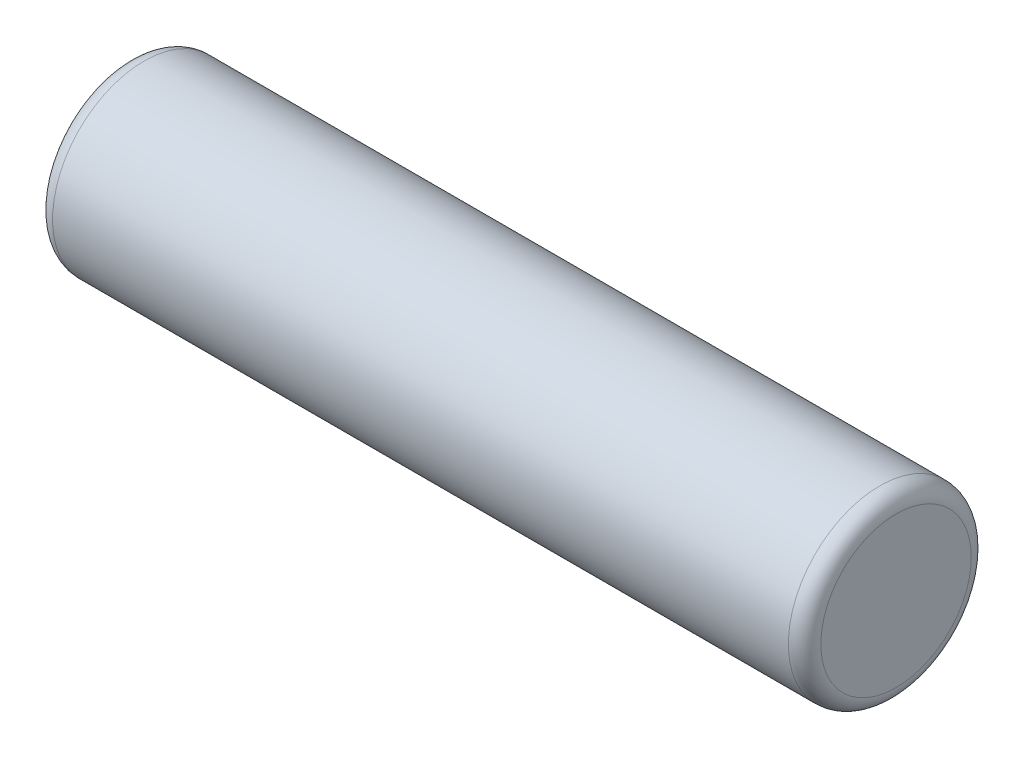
ISO-10303-21;
HEADER;
FILE_DESCRIPTION(('STEP AP214'),'2;1');
FILE_NAME('part.step','',(''),(''),'','','');
FILE_SCHEMA(('AUTOMOTIVE_DESIGN { 1 0 10303 214 1 1 1 1 }'));
ENDSEC;
DATA;
#1=APPLICATION_CONTEXT('core data for automotive mechanical design processes');
#2=APPLICATION_PROTOCOL_DEFINITION('international standard','automotive_design',2000,#1);
#3=PRODUCT_CONTEXT('',#1,'mechanical');
#4=PRODUCT('Part','Part','',(#3));
#5=PRODUCT_RELATED_PRODUCT_CATEGORY('part','',(#4));
#6=PRODUCT_DEFINITION_FORMATION('','',#4);
#7=PRODUCT_DEFINITION_CONTEXT('part definition',#1,'design');
#8=PRODUCT_DEFINITION('design','',#6,#7);
#9=PRODUCT_DEFINITION_SHAPE('','',#8);
#10=(LENGTH_UNIT() NAMED_UNIT(*) SI_UNIT(.MILLI.,.METRE.));
#11=(NAMED_UNIT(*) PLANE_ANGLE_UNIT() SI_UNIT($,.RADIAN.));
#12=(NAMED_UNIT(*) SI_UNIT($,.STERADIAN.) SOLID_ANGLE_UNIT());
#13=UNCERTAINTY_MEASURE_WITH_UNIT(LENGTH_MEASURE(1.E-05),#10,'distance_accuracy_value','');
#14=(GEOMETRIC_REPRESENTATION_CONTEXT(3) GLOBAL_UNCERTAINTY_ASSIGNED_CONTEXT((#13)) GLOBAL_UNIT_ASSIGNED_CONTEXT((#10,
#11,#12)) REPRESENTATION_CONTEXT('',''));
#15=CARTESIAN_POINT('',(0.,0.,0.));
#16=DIRECTION('',(0.,0.,1.));
#17=DIRECTION('',(1.,0.,0.));
#18=AXIS2_PLACEMENT_3D('',#15,#16,#17);
#19=CARTESIAN_POINT('',(1.98333333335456,6.75,0.));
#20=DIRECTION('',(1.,0.,0.));
#21=DIRECTION('',(0.,0.,-1.));
#22=AXIS2_PLACEMENT_3D('',#19,#20,#21);
#23=TOROIDAL_SURFACE('',#22,0.616666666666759,0.133333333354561);
#24=CARTESIAN_POINT('',(1.85,6.75,0.));
#25=DIRECTION('',(1.,0.,0.));
#26=DIRECTION('',(0.,0.,-1.));
#27=AXIS2_PLACEMENT_3D('',#24,#25,#26);
#28=CIRCLE('',#27,0.616666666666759);
#29=CARTESIAN_POINT('',(1.85,6.75,-0.616666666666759));
#30=VERTEX_POINT('',#29);
#31=EDGE_CURVE('E10',#30,#30,#28,.T.);
#32=ORIENTED_EDGE('',*,*,#31,.T.);
#33=EDGE_LOOP('',(#32));
#34=FACE_BOUND('',#33,.T.);
#35=CARTESIAN_POINT('',(1.98333333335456,6.75,0.));
#36=DIRECTION('',(1.,0.,0.));
#37=DIRECTION('',(0.,0.,-1.));
#38=AXIS2_PLACEMENT_3D('',#35,#36,#37);
#39=CIRCLE('',#38,0.75000000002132);
#40=CARTESIAN_POINT('',(1.98333333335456,6.75,-0.75000000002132));
#41=VERTEX_POINT('',#40);
#42=EDGE_CURVE('E47',#41,#41,#39,.T.);
#43=ORIENTED_EDGE('',*,*,#42,.F.);
#44=EDGE_LOOP('',(#43));
#45=FACE_BOUND('',#44,.T.);
#46=ADVANCED_FACE('F33',(#34,#45),#23,.T.);
#47=CARTESIAN_POINT('',(1.85,7.36666666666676,0.));
#48=DIRECTION('',(-1.,0.,0.));
#49=DIRECTION('',(0.,0.,1.));
#50=AXIS2_PLACEMENT_3D('',#47,#48,#49);
#51=PLANE('',#50);
#52=ORIENTED_EDGE('',*,*,#31,.F.);
#53=EDGE_LOOP('',(#52));
#54=FACE_BOUND('',#53,.T.);
#55=ADVANCED_FACE('F57',(#54),#51,.T.);
#56=CARTESIAN_POINT('',(8.15000000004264,6.75,0.));
#57=DIRECTION('',(1.,0.,0.));
#58=DIRECTION('',(0.,0.,-1.));
#59=AXIS2_PLACEMENT_3D('',#56,#57,#58);
#60=PLANE('',#59);
#61=CARTESIAN_POINT('',(8.15000000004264,6.75,0.));
#62=DIRECTION('',(1.,0.,0.));
#63=DIRECTION('',(0.,0.,-1.));
#64=AXIS2_PLACEMENT_3D('',#61,#62,#63);
#65=CIRCLE('',#64,0.61666666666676);
#66=CARTESIAN_POINT('',(8.15000000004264,6.75,-0.61666666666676));
#67=VERTEX_POINT('',#66);
#68=EDGE_CURVE('E39',#67,#67,#65,.T.);
#69=ORIENTED_EDGE('',*,*,#68,.T.);
#70=EDGE_LOOP('',(#69));
#71=FACE_BOUND('',#70,.T.);
#72=ADVANCED_FACE('F61',(#71),#60,.T.);
#73=CARTESIAN_POINT('',(8.01666666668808,6.75,0.));
#74=DIRECTION('',(1.,0.,0.));
#75=DIRECTION('',(0.,0.,-1.));
#76=AXIS2_PLACEMENT_3D('',#73,#74,#75);
#77=TOROIDAL_SURFACE('',#76,0.61666666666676,0.13333333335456);
#78=CARTESIAN_POINT('',(8.01666666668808,6.75,0.));
#79=DIRECTION('',(1.,0.,0.));
#80=DIRECTION('',(0.,0.,-1.));
#81=AXIS2_PLACEMENT_3D('',#78,#79,#80);
#82=CIRCLE('',#81,0.75000000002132);
#83=CARTESIAN_POINT('',(8.01666666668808,6.75,-0.75000000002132));
#84=VERTEX_POINT('',#83);
#85=EDGE_CURVE('E43',#84,#84,#82,.T.);
#86=ORIENTED_EDGE('',*,*,#85,.T.);
#87=EDGE_LOOP('',(#86));
#88=FACE_BOUND('',#87,.T.);
#89=ORIENTED_EDGE('',*,*,#68,.F.);
#90=EDGE_LOOP('',(#89));
#91=FACE_BOUND('',#90,.T.);
#92=ADVANCED_FACE('F66',(#88,#91),#77,.T.);
#93=CARTESIAN_POINT('',(1.84874156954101,6.75,0.));
#94=DIRECTION('',(1.,0.,0.));
#95=DIRECTION('',(0.,0.,-1.));
#96=AXIS2_PLACEMENT_3D('',#93,#94,#95);
#97=CYLINDRICAL_SURFACE('',#96,0.75000000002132);
#98=ORIENTED_EDGE('',*,*,#42,.T.);
#99=EDGE_LOOP('',(#98));
#100=FACE_BOUND('',#99,.T.);
#101=ORIENTED_EDGE('',*,*,#85,.F.);
#102=EDGE_LOOP('',(#101));
#103=FACE_BOUND('',#102,.T.);
#104=ADVANCED_FACE('F53',(#100,#103),#97,.T.);
#105=CLOSED_SHELL('',(#46,#55,#72,#92,#104));
#106=MANIFOLD_SOLID_BREP('B2',#105);
#107=ADVANCED_BREP_SHAPE_REPRESENTATION('',(#18,#106),#14);
#108=SHAPE_DEFINITION_REPRESENTATION(#9,#107);
ENDSEC;
END-ISO-10303-21;
